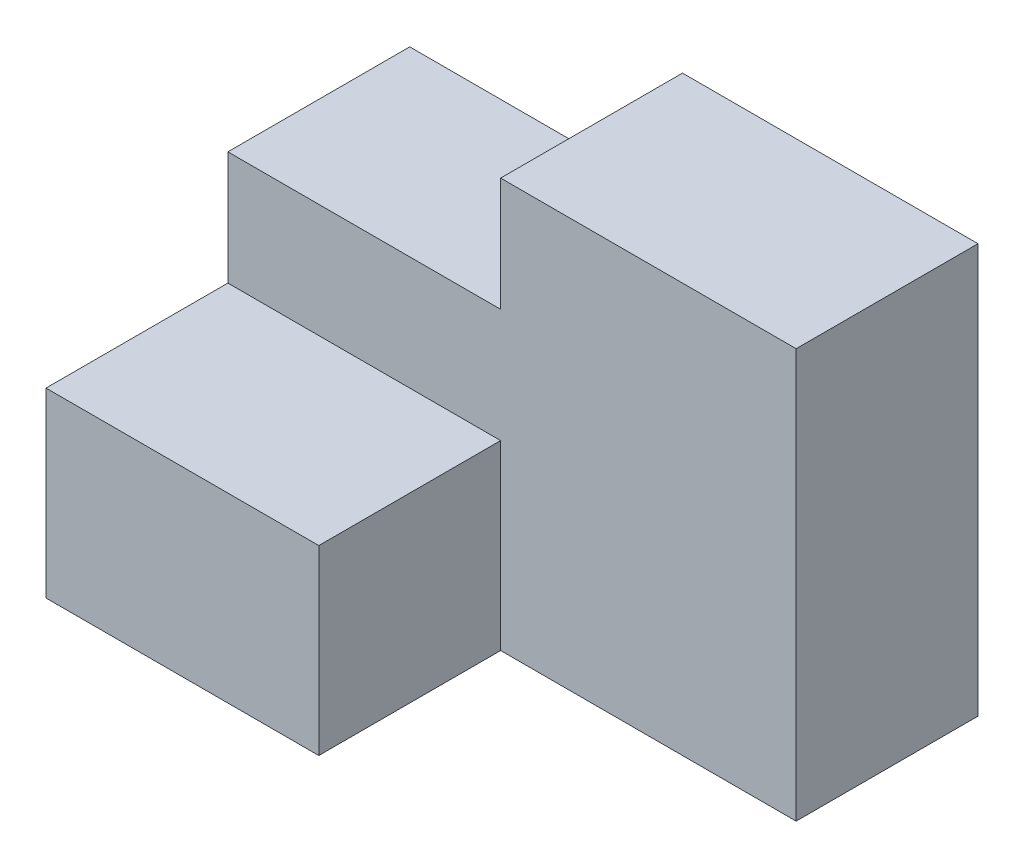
from build123d import *

# Parameters (mm, degrees)
EXTRUDE_1_DEPTH = 32
SKETCH_2_W      = 48
SKETCH_2_H      = 32
EXTRUDE_2_DEPTH = 32


with BuildPart() as part:
    # Sketch 1 → Extrude 1 (new body)
    with BuildSketch(Plane.XY):
        Polygon((0, 52), (48, 52), (48, 72), (100, 72), (100, 0), (0, 0), align=None)
    extrude(amount=EXTRUDE_1_DEPTH)

    # Sketch 2 → Extrude 2 (add)
    with BuildSketch(Plane.XY.offset(32)):
        with Locations((24, 16)):
            Rectangle(SKETCH_2_W, SKETCH_2_H)
    extrude(amount=EXTRUDE_2_DEPTH)


solid = part.part
